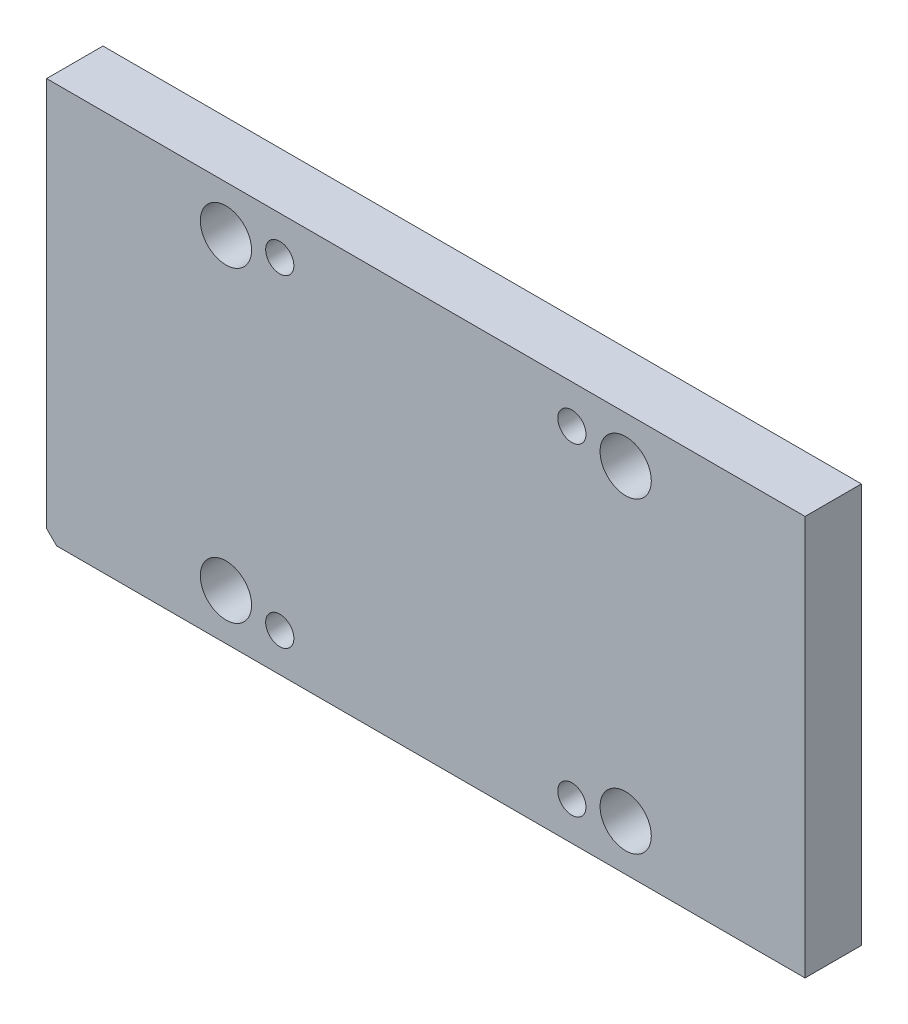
from build123d import *

# Parameters (mm, degrees)
SKETCH1_W            = 296
SKETCH1_H            = 156
BOSS_EXTRUDE1_DEPTH  = 22
DIAMETER_HOLE1_D     = 20
DIAMETER_HOLE1_DEPTH = 22
DIAMETER_HOLE1_TIP   = 6.00860619
HOLE1_D              = 11
HOLE1_CBORE_D        = 18
HOLE1_CBORE_DEPTH    = 13
SKETCH6_R            = 45
CUT_EXTRUDE1_DEPTH   = 4.05
CHAMFER1_SIZE        = 3.92


with BuildPart() as part:
    # Sketch1 → Boss-Extrude1 (new body)
    with BuildSketch(Plane.XY):
        Rectangle(SKETCH1_W, SKETCH1_H)
    extrude(amount=-BOSS_EXTRUDE1_DEPTH)

    # Diameter Hole1
    with Locations(Plane(origin=(-522.991452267, 0, 0), x_dir=(1, 0, 0), z_dir=(0, 0, 1))):
        with Locations((600.991452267, -60), (444.991452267, -60), (444.991452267, 60), (600.991452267, 60)):
            Hole(DIAMETER_HOLE1_D / 2, depth=DIAMETER_HOLE1_DEPTH)
            with Locations((0, 0, -(DIAMETER_HOLE1_DEPTH + DIAMETER_HOLE1_TIP / 2))):  # 118° drill point
                Cone(0, DIAMETER_HOLE1_D / 2, DIAMETER_HOLE1_TIP, mode=Mode.SUBTRACT)

    # Hole1 (through all)
    with Locations(Plane(origin=(0, 0, -22), x_dir=(1, 0, 0), z_dir=(0, 0, -1))):
        with Locations((57, 63), (-57, 63), (-57, -63), (57, -63)):
            CounterBoreHole(HOLE1_D / 2, HOLE1_CBORE_D / 2, HOLE1_CBORE_DEPTH)

    # Sketch6 → Cut-Extrude1 (cut)
    with BuildSketch(Plane.XY.offset(-22)):
        Circle(SKETCH6_R)
    extrude(amount=CUT_EXTRUDE1_DEPTH, mode=Mode.SUBTRACT)

    # Chamfer1
    chamfer1_edges = [part.edges().sort_by_distance(p)[0] for p in [
        (-148, -78, -11),
    ]]
    chamfer(chamfer1_edges, length=CHAMFER1_SIZE)


solid = part.part
